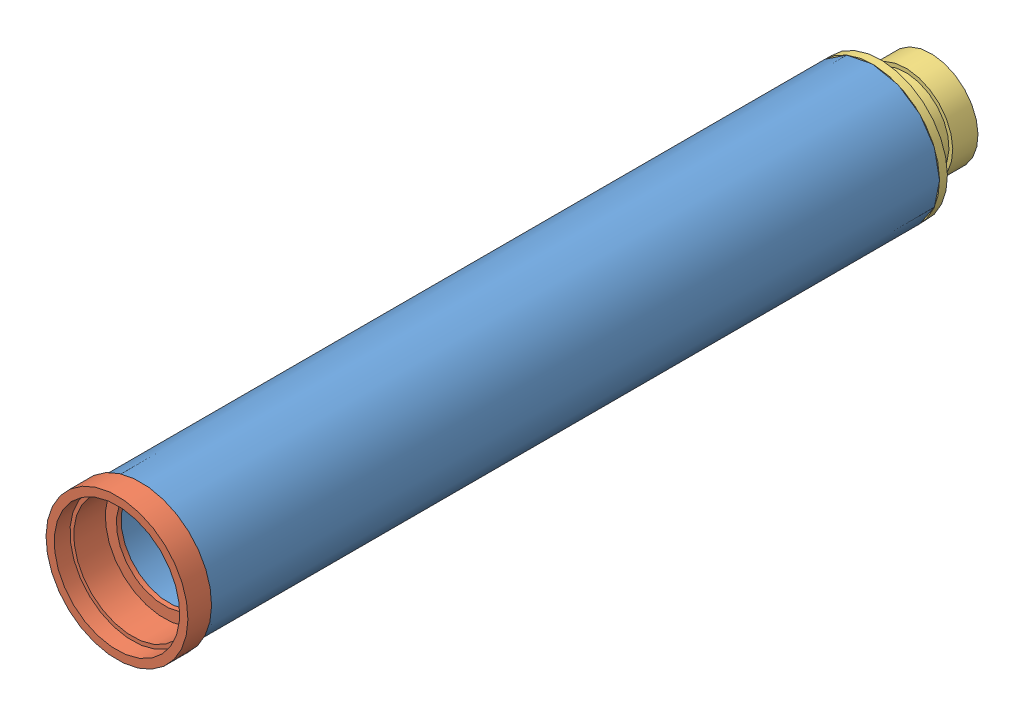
SolidWorks assembly Motor.SLDASM, configuration Default (file format 3100). Lengths in mm.
Overall size (78.29 78.29 327.66).
3 component instances, 3 part files, 3 mates.
Components (placement in the parent):
- Tube-1: Tube.SLDPRT [Default] at (-7.6172 17.7558 -155.3636) size (54.1 54.1 294.64)
- Bottom-1: Bottom.SLDPRT [Default] at (-7.6172 17.7558 127.8464) x (-0.509484 -0.86048 0) z (0 0 1) size (57.15 57.15 20.96)
- Top-2: Top.SLDPRT [Default] at (-7.6172 17.7558 -142.6636) x (-0.041526 -0.999137 0) z (0 0 -1) size (54.1 54.1 36.2)
Mates (geometry in assembly coordinates):
- Coincident1: coincident aligned: circle of Tube-1 centre (-7.6172 17.7558 139.2764) axis (0 0 1); circle of Bottom-1 centre (-7.6172 17.7558 139.2764) axis (0 0 1)
- Concentric7: concentric anti-aligned: cylinder of Tube-1; cylinder of Top-2
- Coincident2: coincident anti-aligned: plane of Tube-1 through (-7.6172 17.7558 -155.3636) normal (0 0 -1); plane of Top-2 through (-7.6172 17.7558 -155.3636) normal (0 0 1)
